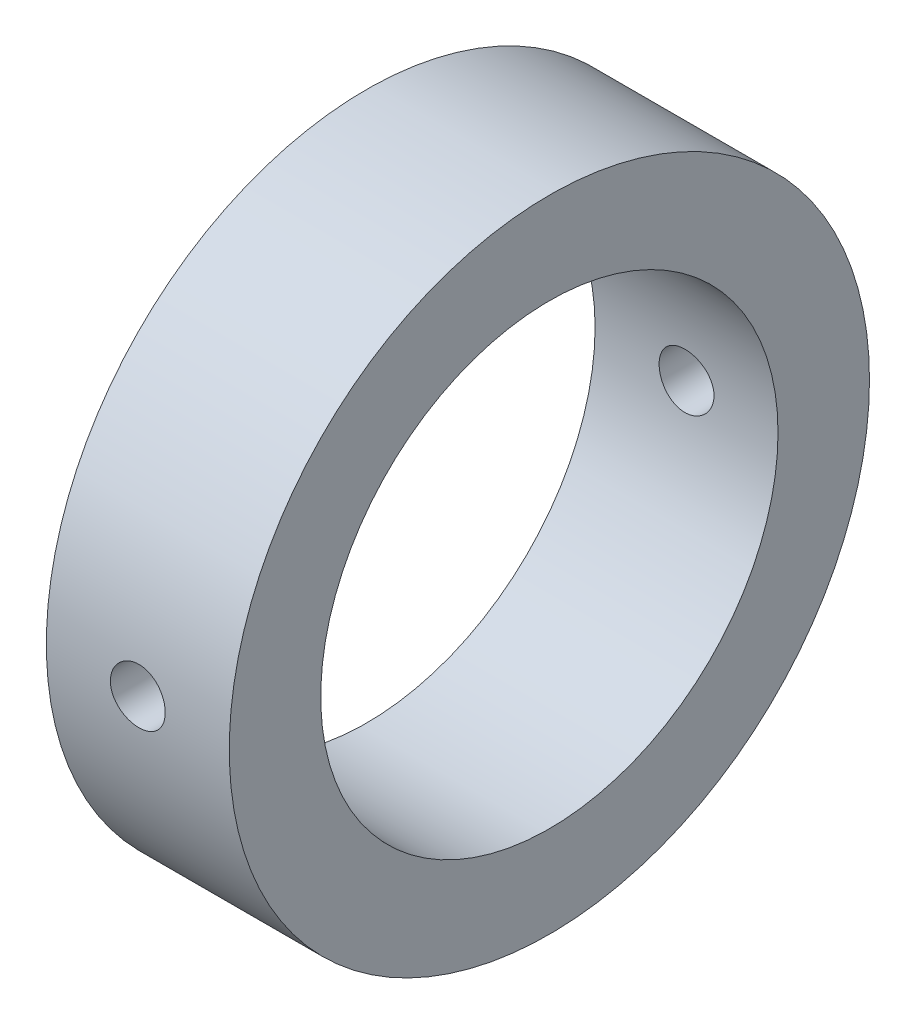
ISO-10303-21;
HEADER;
FILE_DESCRIPTION(('STEP AP214'),'2;1');
FILE_NAME('part.step','',(''),(''),'','','');
FILE_SCHEMA(('AUTOMOTIVE_DESIGN { 1 0 10303 214 1 1 1 1 }'));
ENDSEC;
DATA;
#1=APPLICATION_CONTEXT('core data for automotive mechanical design processes');
#2=APPLICATION_PROTOCOL_DEFINITION('international standard','automotive_design',2000,#1);
#3=PRODUCT_CONTEXT('',#1,'mechanical');
#4=PRODUCT('Part','Part','',(#3));
#5=PRODUCT_RELATED_PRODUCT_CATEGORY('part','',(#4));
#6=PRODUCT_DEFINITION_FORMATION('','',#4);
#7=PRODUCT_DEFINITION_CONTEXT('part definition',#1,'design');
#8=PRODUCT_DEFINITION('design','',#6,#7);
#9=PRODUCT_DEFINITION_SHAPE('','',#8);
#10=(LENGTH_UNIT() NAMED_UNIT(*) SI_UNIT(.MILLI.,.METRE.));
#11=(NAMED_UNIT(*) PLANE_ANGLE_UNIT() SI_UNIT($,.RADIAN.));
#12=(NAMED_UNIT(*) SI_UNIT($,.STERADIAN.) SOLID_ANGLE_UNIT());
#13=UNCERTAINTY_MEASURE_WITH_UNIT(LENGTH_MEASURE(1.E-05),#10,'distance_accuracy_value','');
#14=(GEOMETRIC_REPRESENTATION_CONTEXT(3) GLOBAL_UNCERTAINTY_ASSIGNED_CONTEXT((#13)) GLOBAL_UNIT_ASSIGNED_CONTEXT((#10,
#11,#12)) REPRESENTATION_CONTEXT('',''));
#15=CARTESIAN_POINT('',(0.,0.,0.));
#16=DIRECTION('',(0.,0.,1.));
#17=DIRECTION('',(1.,0.,0.));
#18=AXIS2_PLACEMENT_3D('',#15,#16,#17);
#19=CARTESIAN_POINT('',(20.,0.,0.));
#20=DIRECTION('',(1.,0.,0.));
#21=DIRECTION('',(0.,0.,-1.));
#22=AXIS2_PLACEMENT_3D('',#19,#20,#21);
#23=PLANE('',#22);
#24=CARTESIAN_POINT('',(20.,0.,0.));
#25=DIRECTION('',(1.,0.,0.));
#26=DIRECTION('',(0.,0.,-1.));
#27=AXIS2_PLACEMENT_3D('',#24,#25,#26);
#28=CIRCLE('',#27,35.);
#29=CARTESIAN_POINT('',(20.,0.,-35.));
#30=VERTEX_POINT('',#29);
#31=EDGE_CURVE('E10',#30,#30,#28,.T.);
#32=ORIENTED_EDGE('',*,*,#31,.T.);
#33=EDGE_LOOP('',(#32));
#34=FACE_BOUND('',#33,.T.);
#35=CARTESIAN_POINT('',(20.,0.,0.));
#36=DIRECTION('',(1.,0.,0.));
#37=DIRECTION('',(0.,0.,-1.));
#38=AXIS2_PLACEMENT_3D('',#35,#36,#37);
#39=CIRCLE('',#38,25.);
#40=CARTESIAN_POINT('',(20.,0.,-25.));
#41=VERTEX_POINT('',#40);
#42=EDGE_CURVE('E60',#41,#41,#39,.T.);
#43=ORIENTED_EDGE('',*,*,#42,.F.);
#44=EDGE_LOOP('',(#43));
#45=FACE_BOUND('',#44,.T.);
#46=ADVANCED_FACE('F41',(#34,#45),#23,.T.);
#47=CARTESIAN_POINT('',(0.,0.,0.));
#48=DIRECTION('',(1.,0.,0.));
#49=DIRECTION('',(0.,0.,-1.));
#50=AXIS2_PLACEMENT_3D('',#47,#48,#49);
#51=PLANE('',#50);
#52=CARTESIAN_POINT('',(0.,0.,0.));
#53=DIRECTION('',(1.,0.,0.));
#54=DIRECTION('',(0.,0.,-1.));
#55=AXIS2_PLACEMENT_3D('',#52,#53,#54);
#56=CIRCLE('',#55,35.);
#57=CARTESIAN_POINT('',(0.,0.,-35.));
#58=VERTEX_POINT('',#57);
#59=EDGE_CURVE('E55',#58,#58,#56,.T.);
#60=ORIENTED_EDGE('',*,*,#59,.F.);
#61=EDGE_LOOP('',(#60));
#62=FACE_BOUND('',#61,.T.);
#63=CARTESIAN_POINT('',(0.,0.,0.));
#64=DIRECTION('',(1.,0.,0.));
#65=DIRECTION('',(0.,0.,-1.));
#66=AXIS2_PLACEMENT_3D('',#63,#64,#65);
#67=CIRCLE('',#66,25.);
#68=CARTESIAN_POINT('',(0.,0.,-25.));
#69=VERTEX_POINT('',#68);
#70=EDGE_CURVE('E63',#69,#69,#67,.T.);
#71=ORIENTED_EDGE('',*,*,#70,.T.);
#72=EDGE_LOOP('',(#71));
#73=FACE_BOUND('',#72,.T.);
#74=ADVANCED_FACE('F99',(#62,#73),#51,.F.);
#75=CARTESIAN_POINT('',(20.,0.,0.));
#76=DIRECTION('',(-1.,0.,0.));
#77=DIRECTION('',(0.,0.,1.));
#78=AXIS2_PLACEMENT_3D('',#75,#76,#77);
#79=CYLINDRICAL_SURFACE('',#78,35.);
#80=CARTESIAN_POINT('',(13.,0.,-35.));
#81=CARTESIAN_POINT('',(12.9999926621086,0.168180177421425,-34.9999983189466));
#82=CARTESIAN_POINT('',(12.9858101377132,0.336474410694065,-34.9987748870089));
#83=CARTESIAN_POINT('',(12.9294427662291,0.668405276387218,-34.9940120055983));
#84=CARTESIAN_POINT('',(12.8872263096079,0.83203643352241,-34.9904699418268));
#85=CARTESIAN_POINT('',(12.7760219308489,1.14978580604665,-34.9814700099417));
#86=CARTESIAN_POINT('',(12.7070492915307,1.30390939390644,-34.9760132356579));
#87=CARTESIAN_POINT('',(12.5443180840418,1.5983553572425,-34.9637955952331));
#88=CARTESIAN_POINT('',(12.4505647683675,1.7386806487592,-34.9570350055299));
#89=CARTESIAN_POINT('',(12.2406617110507,2.00196024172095,-34.9429478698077));
#90=CARTESIAN_POINT('',(12.1244591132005,2.12487233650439,-34.9356200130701));
#91=CARTESIAN_POINT('',(11.8730679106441,2.34947428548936,-34.9212352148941));
#92=CARTESIAN_POINT('',(11.7378784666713,2.45116320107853,-34.9141782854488));
#93=CARTESIAN_POINT('',(11.4520942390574,2.63057608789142,-34.9011203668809));
#94=CARTESIAN_POINT('',(11.3014759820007,2.70826279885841,-34.895121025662));
#95=CARTESIAN_POINT('',(10.9892731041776,2.83722803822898,-34.8848727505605));
#96=CARTESIAN_POINT('',(10.8276886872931,2.88850705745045,-34.8806237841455));
#97=CARTESIAN_POINT('',(10.4985643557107,2.96307845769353,-34.8743684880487));
#98=CARTESIAN_POINT('',(10.3310401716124,2.98643979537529,-34.8723566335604));
#99=CARTESIAN_POINT('',(9.99443731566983,3.00472573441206,-34.8707859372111));
#100=CARTESIAN_POINT('',(9.82535867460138,2.99965089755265,-34.8712270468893));
#101=CARTESIAN_POINT('',(9.49091935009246,2.96126551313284,-34.874507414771));
#102=CARTESIAN_POINT('',(9.32554998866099,2.92802995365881,-34.8773403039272));
#103=CARTESIAN_POINT('',(9.00274549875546,2.83438308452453,-34.8850750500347));
#104=CARTESIAN_POINT('',(8.84531045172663,2.77397149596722,-34.8899769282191));
#105=CARTESIAN_POINT('',(8.54260489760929,2.62760362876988,-34.9013046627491));
#106=CARTESIAN_POINT('',(8.39735071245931,2.54161375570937,-34.9077325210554));
#107=CARTESIAN_POINT('',(8.12330862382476,2.34655446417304,-34.9213861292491));
#108=CARTESIAN_POINT('',(7.99452107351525,2.23748455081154,-34.9286118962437));
#109=CARTESIAN_POINT('',(7.75663207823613,1.99894091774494,-34.9430754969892));
#110=CARTESIAN_POINT('',(7.64759561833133,1.86940237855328,-34.9503132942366));
#111=CARTESIAN_POINT('',(7.45280656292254,1.59382461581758,-34.9639632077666));
#112=CARTESIAN_POINT('',(7.36705398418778,1.44778538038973,-34.9703753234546));
#113=CARTESIAN_POINT('',(7.2212707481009,1.1433091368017,-34.9816527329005));
#114=CARTESIAN_POINT('',(7.16124302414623,0.984870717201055,-34.9865178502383));
#115=CARTESIAN_POINT('',(7.06865924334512,0.660113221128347,-34.9941511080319));
#116=CARTESIAN_POINT('',(7.03610258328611,0.493794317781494,-34.9969192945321));
#117=CARTESIAN_POINT('',(6.99946669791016,0.158560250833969,-35.0000408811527));
#118=CARTESIAN_POINT('',(6.99529772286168,-0.0103450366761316,-35.0004018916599));
#119=CARTESIAN_POINT('',(7.01532035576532,-0.34645210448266,-34.9986887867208));
#120=CARTESIAN_POINT('',(7.03951168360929,-0.513653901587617,-34.9966146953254));
#121=CARTESIAN_POINT('',(7.11549382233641,-0.841351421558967,-34.9902695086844));
#122=CARTESIAN_POINT('',(7.16724297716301,-1.00185687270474,-34.9860017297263));
#123=CARTESIAN_POINT('',(7.29682922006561,-1.31190702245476,-34.9757485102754));
#124=CARTESIAN_POINT('',(7.37466674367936,-1.46145153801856,-34.9697630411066));
#125=CARTESIAN_POINT('',(7.55444535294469,-1.7457428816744,-34.9567262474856));
#126=CARTESIAN_POINT('',(7.65644583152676,-1.88045202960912,-34.9496723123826));
#127=CARTESIAN_POINT('',(7.88156921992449,-2.13086824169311,-34.9352996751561));
#128=CARTESIAN_POINT('',(8.00469251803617,-2.24657495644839,-34.9279809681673));
#129=CARTESIAN_POINT('',(8.26895626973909,-2.45601016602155,-34.9138810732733));
#130=CARTESIAN_POINT('',(8.41014326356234,-2.54968004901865,-34.9071013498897));
#131=CARTESIAN_POINT('',(8.70629524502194,-2.71198063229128,-34.8948680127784));
#132=CARTESIAN_POINT('',(8.8612600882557,-2.78061159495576,-34.8894143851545));
#133=CARTESIAN_POINT('',(9.18036221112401,-2.8907865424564,-34.8804590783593));
#134=CARTESIAN_POINT('',(9.34448707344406,-2.93236627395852,-34.8769548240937));
#135=CARTESIAN_POINT('',(9.67742005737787,-2.98737479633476,-34.872286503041));
#136=CARTESIAN_POINT('',(9.84622808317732,-3.0008041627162,-34.871122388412));
#137=CARTESIAN_POINT('',(10.1831530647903,-2.99912392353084,-34.8712668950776));
#138=CARTESIAN_POINT('',(10.3512704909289,-2.98410640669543,-34.8725675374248));
#139=CARTESIAN_POINT('',(10.6825859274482,-2.92615085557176,-34.8774780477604));
#140=CARTESIAN_POINT('',(10.8457839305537,-2.88321277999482,-34.8810879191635));
#141=CARTESIAN_POINT('',(11.1626330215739,-2.7706585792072,-34.8902080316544));
#142=CARTESIAN_POINT('',(11.3162847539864,-2.70104425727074,-34.8957181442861));
#143=CARTESIAN_POINT('',(11.6097355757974,-2.53712384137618,-34.9080181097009));
#144=CARTESIAN_POINT('',(11.7495348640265,-2.4428181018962,-34.9148079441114));
#145=CARTESIAN_POINT('',(12.0117838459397,-2.23184571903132,-34.9289284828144));
#146=CARTESIAN_POINT('',(12.1341785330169,-2.11511080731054,-34.9362607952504));
#147=CARTESIAN_POINT('',(12.357688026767,-1.86271960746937,-34.9506254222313));
#148=CARTESIAN_POINT('',(12.4587976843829,-1.72705875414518,-34.9576576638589));
#149=CARTESIAN_POINT('',(12.6370108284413,-1.44039065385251,-34.9706432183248));
#150=CARTESIAN_POINT('',(12.7140672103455,-1.28935405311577,-34.9765944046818));
#151=CARTESIAN_POINT('',(12.8416267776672,-0.976537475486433,-34.9867226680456));
#152=CARTESIAN_POINT('',(12.8921604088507,-0.814770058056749,-34.9909017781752));
#153=CARTESIAN_POINT('',(12.9524054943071,-0.543377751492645,-34.9959451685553));
#154=CARTESIAN_POINT('',(12.9702296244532,-0.4354969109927,-34.9974587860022));
#155=CARTESIAN_POINT('',(12.9940292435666,-0.218426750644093,-34.999486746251));
#156=CARTESIAN_POINT('',(13.0000047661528,-0.109237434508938,-35.0000010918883));
#157=CARTESIAN_POINT('',(13.,0.,-35.));
#158=B_SPLINE_CURVE_WITH_KNOTS('',3,(#80,#81,#82,#83,#84,#85,#86,#87,#88,#89,#90,#91,#92,#93,
#94,#95,#96,#97,#98,#99,#100,#101,#102,#103,#104,#105,#106,#107,#108,#109,#110,#111,#112,#113,
#114,#115,#116,#117,#118,#119,#120,#121,#122,#123,#124,#125,#126,#127,#128,#129,#130,#131,#132,
#133,#134,#135,#136,#137,#138,#139,#140,#141,#142,#143,#144,#145,#146,#147,#148,#149,#150,#151,
#152,#153,#154,#155,#156,#157),.UNSPECIFIED.,.T.,.F.,(4,2,2,2,2,2,2,2,2,2,2,2,2,2,2,2,2,2,2,2,2,
2,2,2,2,2,2,2,2,2,2,2,2,2,2,2,2,2,4),(0.,0.504141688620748,1.0088527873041,1.51327602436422,
2.01759242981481,2.5231110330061,3.0286519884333,3.53497383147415,4.04128626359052,
4.54634550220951,5.05139476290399,5.55510335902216,6.05881712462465,6.56319540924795,
7.06758450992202,7.57360414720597,8.07962414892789,8.58570183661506,9.09176841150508,
9.59623427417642,10.1006951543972,10.6043956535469,11.1081045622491,11.6130646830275,
12.1180340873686,12.6243317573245,13.1306241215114,13.636246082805,14.1418577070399,
14.6458353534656,15.1498137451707,15.6537580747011,16.1576951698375,16.6631911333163,
17.1688092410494,17.6754113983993,18.1814307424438,18.5088849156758,18.8363381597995),.UNSPECIFIED.);
#159=CARTESIAN_POINT('',(13.,0.,-35.));
#160=VERTEX_POINT('',#159);
#161=EDGE_CURVE('E88',#160,#160,#158,.T.);
#162=ORIENTED_EDGE('',*,*,#161,.T.);
#163=EDGE_LOOP('',(#162));
#164=FACE_BOUND('',#163,.T.);
#165=CARTESIAN_POINT('',(13.,0.,35.));
#166=CARTESIAN_POINT('',(12.9999926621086,-0.168180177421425,34.9999983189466));
#167=CARTESIAN_POINT('',(12.9858101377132,-0.336474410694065,34.9987748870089));
#168=CARTESIAN_POINT('',(12.9294427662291,-0.668405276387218,34.9940120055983));
#169=CARTESIAN_POINT('',(12.8872263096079,-0.83203643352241,34.9904699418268));
#170=CARTESIAN_POINT('',(12.7760219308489,-1.14978580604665,34.9814700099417));
#171=CARTESIAN_POINT('',(12.7070492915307,-1.30390939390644,34.9760132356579));
#172=CARTESIAN_POINT('',(12.5443180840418,-1.5983553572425,34.9637955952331));
#173=CARTESIAN_POINT('',(12.4505647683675,-1.7386806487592,34.9570350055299));
#174=CARTESIAN_POINT('',(12.2406617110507,-2.00196024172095,34.9429478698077));
#175=CARTESIAN_POINT('',(12.1244591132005,-2.12487233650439,34.9356200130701));
#176=CARTESIAN_POINT('',(11.8730679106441,-2.34947428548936,34.9212352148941));
#177=CARTESIAN_POINT('',(11.7378784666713,-2.45116320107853,34.9141782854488));
#178=CARTESIAN_POINT('',(11.4520942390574,-2.63057608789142,34.9011203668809));
#179=CARTESIAN_POINT('',(11.3014759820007,-2.70826279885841,34.895121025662));
#180=CARTESIAN_POINT('',(10.9892731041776,-2.83722803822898,34.8848727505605));
#181=CARTESIAN_POINT('',(10.8276886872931,-2.88850705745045,34.8806237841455));
#182=CARTESIAN_POINT('',(10.4985643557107,-2.96307845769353,34.8743684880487));
#183=CARTESIAN_POINT('',(10.3310401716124,-2.98643979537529,34.8723566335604));
#184=CARTESIAN_POINT('',(9.99443731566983,-3.00472573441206,34.8707859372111));
#185=CARTESIAN_POINT('',(9.82535867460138,-2.99965089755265,34.8712270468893));
#186=CARTESIAN_POINT('',(9.49091935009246,-2.96126551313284,34.874507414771));
#187=CARTESIAN_POINT('',(9.32554998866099,-2.92802995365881,34.8773403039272));
#188=CARTESIAN_POINT('',(9.00274549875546,-2.83438308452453,34.8850750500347));
#189=CARTESIAN_POINT('',(8.84531045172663,-2.77397149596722,34.8899769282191));
#190=CARTESIAN_POINT('',(8.54260489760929,-2.62760362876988,34.9013046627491));
#191=CARTESIAN_POINT('',(8.39735071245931,-2.54161375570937,34.9077325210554));
#192=CARTESIAN_POINT('',(8.12330862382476,-2.34655446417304,34.9213861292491));
#193=CARTESIAN_POINT('',(7.99452107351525,-2.23748455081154,34.9286118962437));
#194=CARTESIAN_POINT('',(7.75663207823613,-1.99894091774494,34.9430754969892));
#195=CARTESIAN_POINT('',(7.64759561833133,-1.86940237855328,34.9503132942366));
#196=CARTESIAN_POINT('',(7.45280656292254,-1.59382461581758,34.9639632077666));
#197=CARTESIAN_POINT('',(7.36705398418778,-1.44778538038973,34.9703753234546));
#198=CARTESIAN_POINT('',(7.2212707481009,-1.1433091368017,34.9816527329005));
#199=CARTESIAN_POINT('',(7.16124302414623,-0.984870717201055,34.9865178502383));
#200=CARTESIAN_POINT('',(7.06865924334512,-0.660113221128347,34.9941511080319));
#201=CARTESIAN_POINT('',(7.03610258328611,-0.493794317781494,34.9969192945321));
#202=CARTESIAN_POINT('',(6.99946669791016,-0.158560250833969,35.0000408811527));
#203=CARTESIAN_POINT('',(6.99529772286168,0.0103450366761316,35.0004018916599));
#204=CARTESIAN_POINT('',(7.01532035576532,0.34645210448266,34.9986887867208));
#205=CARTESIAN_POINT('',(7.03951168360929,0.513653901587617,34.9966146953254));
#206=CARTESIAN_POINT('',(7.11549382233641,0.841351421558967,34.9902695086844));
#207=CARTESIAN_POINT('',(7.16724297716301,1.00185687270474,34.9860017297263));
#208=CARTESIAN_POINT('',(7.29682922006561,1.31190702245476,34.9757485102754));
#209=CARTESIAN_POINT('',(7.37466674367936,1.46145153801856,34.9697630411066));
#210=CARTESIAN_POINT('',(7.55444535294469,1.7457428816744,34.9567262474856));
#211=CARTESIAN_POINT('',(7.65644583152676,1.88045202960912,34.9496723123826));
#212=CARTESIAN_POINT('',(7.88156921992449,2.13086824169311,34.9352996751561));
#213=CARTESIAN_POINT('',(8.00469251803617,2.24657495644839,34.9279809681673));
#214=CARTESIAN_POINT('',(8.26895626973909,2.45601016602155,34.9138810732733));
#215=CARTESIAN_POINT('',(8.41014326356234,2.54968004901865,34.9071013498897));
#216=CARTESIAN_POINT('',(8.70629524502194,2.71198063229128,34.8948680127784));
#217=CARTESIAN_POINT('',(8.8612600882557,2.78061159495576,34.8894143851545));
#218=CARTESIAN_POINT('',(9.18036221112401,2.8907865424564,34.8804590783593));
#219=CARTESIAN_POINT('',(9.34448707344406,2.93236627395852,34.8769548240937));
#220=CARTESIAN_POINT('',(9.67742005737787,2.98737479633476,34.872286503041));
#221=CARTESIAN_POINT('',(9.84622808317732,3.0008041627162,34.871122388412));
#222=CARTESIAN_POINT('',(10.1831530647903,2.99912392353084,34.8712668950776));
#223=CARTESIAN_POINT('',(10.3512704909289,2.98410640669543,34.8725675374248));
#224=CARTESIAN_POINT('',(10.6825859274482,2.92615085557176,34.8774780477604));
#225=CARTESIAN_POINT('',(10.8457839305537,2.88321277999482,34.8810879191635));
#226=CARTESIAN_POINT('',(11.1626330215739,2.7706585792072,34.8902080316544));
#227=CARTESIAN_POINT('',(11.3162847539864,2.70104425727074,34.8957181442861));
#228=CARTESIAN_POINT('',(11.6097355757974,2.53712384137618,34.9080181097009));
#229=CARTESIAN_POINT('',(11.7495348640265,2.4428181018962,34.9148079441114));
#230=CARTESIAN_POINT('',(12.0117838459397,2.23184571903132,34.9289284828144));
#231=CARTESIAN_POINT('',(12.1341785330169,2.11511080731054,34.9362607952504));
#232=CARTESIAN_POINT('',(12.357688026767,1.86271960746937,34.9506254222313));
#233=CARTESIAN_POINT('',(12.4587976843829,1.72705875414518,34.9576576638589));
#234=CARTESIAN_POINT('',(12.6370108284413,1.44039065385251,34.9706432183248));
#235=CARTESIAN_POINT('',(12.7140672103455,1.28935405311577,34.9765944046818));
#236=CARTESIAN_POINT('',(12.8416267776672,0.976537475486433,34.9867226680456));
#237=CARTESIAN_POINT('',(12.8921604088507,0.814770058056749,34.9909017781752));
#238=CARTESIAN_POINT('',(12.9524054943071,0.543377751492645,34.9959451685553));
#239=CARTESIAN_POINT('',(12.9702296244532,0.4354969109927,34.9974587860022));
#240=CARTESIAN_POINT('',(12.9940292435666,0.218426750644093,34.999486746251));
#241=CARTESIAN_POINT('',(13.0000047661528,0.109237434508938,35.0000010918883));
#242=CARTESIAN_POINT('',(13.,0.,35.));
#243=B_SPLINE_CURVE_WITH_KNOTS('',3,(#165,#166,#167,#168,#169,#170,#171,#172,#173,#174,#175,
#176,#177,#178,#179,#180,#181,#182,#183,#184,#185,#186,#187,#188,#189,#190,#191,#192,#193,#194,
#195,#196,#197,#198,#199,#200,#201,#202,#203,#204,#205,#206,#207,#208,#209,#210,#211,#212,#213,
#214,#215,#216,#217,#218,#219,#220,#221,#222,#223,#224,#225,#226,#227,#228,#229,#230,#231,#232,
#233,#234,#235,#236,#237,#238,#239,#240,#241,#242),.UNSPECIFIED.,.T.,.F.,(4,2,2,2,2,2,2,2,2,2,2,
2,2,2,2,2,2,2,2,2,2,2,2,2,2,2,2,2,2,2,2,2,2,2,2,2,2,2,4),(0.,0.504141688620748,1.0088527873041,
1.51327602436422,2.01759242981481,2.5231110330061,3.0286519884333,3.53497383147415,
4.04128626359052,4.54634550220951,5.05139476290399,5.55510335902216,6.05881712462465,
6.56319540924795,7.06758450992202,7.57360414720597,8.07962414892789,8.58570183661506,
9.09176841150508,9.59623427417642,10.1006951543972,10.6043956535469,11.1081045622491,
11.6130646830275,12.1180340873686,12.6243317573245,13.1306241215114,13.636246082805,
14.1418577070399,14.6458353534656,15.1498137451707,15.6537580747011,16.1576951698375,
16.6631911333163,17.1688092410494,17.6754113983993,18.1814307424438,18.5088849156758,
18.8363381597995),.UNSPECIFIED.);
#244=CARTESIAN_POINT('',(13.,0.,35.));
#245=VERTEX_POINT('',#244);
#246=EDGE_CURVE('E83',#245,#245,#243,.T.);
#247=ORIENTED_EDGE('',*,*,#246,.T.);
#248=EDGE_LOOP('',(#247));
#249=FACE_BOUND('',#248,.T.);
#250=ORIENTED_EDGE('',*,*,#31,.F.);
#251=EDGE_LOOP('',(#250));
#252=FACE_BOUND('',#251,.T.);
#253=ORIENTED_EDGE('',*,*,#59,.T.);
#254=EDGE_LOOP('',(#253));
#255=FACE_BOUND('',#254,.T.);
#256=ADVANCED_FACE('F43',(#164,#249,#252,#255),#79,.T.);
#257=CARTESIAN_POINT('',(20.,0.,0.));
#258=DIRECTION('',(-1.,0.,0.));
#259=DIRECTION('',(0.,0.,1.));
#260=AXIS2_PLACEMENT_3D('',#257,#258,#259);
#261=CYLINDRICAL_SURFACE('',#260,25.);
#262=CARTESIAN_POINT('',(13.,0.,25.));
#263=CARTESIAN_POINT('',(12.9999928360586,-0.167864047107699,24.9999977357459));
#264=CARTESIAN_POINT('',(12.9858633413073,-0.335834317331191,24.9982914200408));
#265=CARTESIAN_POINT('',(12.9297189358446,-0.66710457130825,24.991648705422));
#266=CARTESIAN_POINT('',(12.8876745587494,-0.830399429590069,24.9867088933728));
#267=CARTESIAN_POINT('',(12.776953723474,-1.14747479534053,24.9741559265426));
#268=CARTESIAN_POINT('',(12.7082947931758,-1.30126148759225,24.9665445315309));
#269=CARTESIAN_POINT('',(12.5463312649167,-1.595099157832,24.9494959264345));
#270=CARTESIAN_POINT('',(12.4530310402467,-1.73515256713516,24.9400590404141));
#271=CARTESIAN_POINT('',(12.2439251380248,-1.99829131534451,24.920360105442));
#272=CARTESIAN_POINT('',(12.1280191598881,-2.1212966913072,24.9100945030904));
#273=CARTESIAN_POINT('',(11.8772070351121,-2.34615931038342,24.8899239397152));
#274=CARTESIAN_POINT('',(11.7422999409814,-2.44801549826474,24.8800189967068));
#275=CARTESIAN_POINT('',(11.4567991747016,-2.62798342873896,24.8616560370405));
#276=CARTESIAN_POINT('',(11.3061582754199,-2.7060207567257,24.8532025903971));
#277=CARTESIAN_POINT('',(10.9937912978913,-2.8356605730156,24.8387461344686));
#278=CARTESIAN_POINT('',(10.8320656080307,-2.88726398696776,24.8327430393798));
#279=CARTESIAN_POINT('',(10.5029471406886,-2.96232930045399,24.8239006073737));
#280=CARTESIAN_POINT('',(10.3355854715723,-2.98592577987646,24.8210461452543));
#281=CARTESIAN_POINT('',(9.99925506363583,-3.0047237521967,24.8187777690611));
#282=CARTESIAN_POINT('',(9.83028638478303,-2.99992630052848,24.8193637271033));
#283=CARTESIAN_POINT('',(9.49647403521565,-2.96218316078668,24.8238961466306));
#284=CARTESIAN_POINT('',(9.33161336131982,-2.92938543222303,24.8278249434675));
#285=CARTESIAN_POINT('',(9.00975297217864,-2.83680346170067,24.8385728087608));
#286=CARTESIAN_POINT('',(8.85275340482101,-2.77701871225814,24.8453919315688));
#287=CARTESIAN_POINT('',(8.55061053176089,-2.63199980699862,24.8611722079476));
#288=CARTESIAN_POINT('',(8.40549852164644,-2.54670106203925,24.8701387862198));
#289=CARTESIAN_POINT('',(8.13159278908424,-2.35312173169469,24.8891993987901));
#290=CARTESIAN_POINT('',(8.00279975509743,-2.24484017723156,24.8992934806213));
#291=CARTESIAN_POINT('',(7.76432891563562,-2.0075475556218,24.9195503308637));
#292=CARTESIAN_POINT('',(7.65477803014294,-1.87840890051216,24.929713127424));
#293=CARTESIAN_POINT('',(7.45888847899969,-1.60350795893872,24.9489020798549));
#294=CARTESIAN_POINT('',(7.37254985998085,-1.45774563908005,24.9579282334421));
#295=CARTESIAN_POINT('',(7.22553671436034,-1.15363930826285,24.9738318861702));
#296=CARTESIAN_POINT('',(7.16486980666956,-0.995291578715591,24.9807087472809));
#297=CARTESIAN_POINT('',(7.0710212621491,-0.670556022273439,24.991533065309));
#298=CARTESIAN_POINT('',(7.03783843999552,-0.504168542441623,24.9954806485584));
#299=CARTESIAN_POINT('',(7.00006374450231,-0.169174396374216,24.9999852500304));
#300=CARTESIAN_POINT('',(6.9952969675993,-0.000587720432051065,25.0005630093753));
#301=CARTESIAN_POINT('',(7.01402857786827,0.334982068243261,24.9983187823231));
#302=CARTESIAN_POINT('',(7.03752641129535,0.501965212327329,24.9954968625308));
#303=CARTESIAN_POINT('',(7.11197496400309,0.829074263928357,24.9867833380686));
#304=CARTESIAN_POINT('',(7.16284261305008,0.989219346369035,24.9809010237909));
#305=CARTESIAN_POINT('',(7.29050070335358,1.29870539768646,24.9667255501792));
#306=CARTESIAN_POINT('',(7.36729196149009,1.44804602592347,24.9584323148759));
#307=CARTESIAN_POINT('',(7.54504291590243,1.73246717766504,24.9403085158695));
#308=CARTESIAN_POINT('',(7.64611613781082,1.86747628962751,24.9304708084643));
#309=CARTESIAN_POINT('',(7.86940084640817,2.11867625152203,24.9103817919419));
#310=CARTESIAN_POINT('',(7.99161310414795,2.23486641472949,24.9001304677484));
#311=CARTESIAN_POINT('',(8.25447561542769,2.44574795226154,24.8803059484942));
#312=CARTESIAN_POINT('',(8.39521901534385,2.54032363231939,24.8707365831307));
#313=CARTESIAN_POINT('',(8.69069502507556,2.70449314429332,24.8534214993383));
#314=CARTESIAN_POINT('',(8.84542737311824,2.77408744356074,24.8456757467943));
#315=CARTESIAN_POINT('',(9.1641106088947,2.88612996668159,24.8329105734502));
#316=CARTESIAN_POINT('',(9.32803801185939,2.92864420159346,24.8278845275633));
#317=CARTESIAN_POINT('',(9.66076896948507,2.98553272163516,24.8211085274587));
#318=CARTESIAN_POINT('',(9.82957231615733,2.99990820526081,24.8193584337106));
#319=CARTESIAN_POINT('',(10.1661127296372,3.00009033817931,24.819336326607));
#320=CARTESIAN_POINT('',(10.3338497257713,2.98607873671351,24.8210421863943));
#321=CARTESIAN_POINT('',(10.6645667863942,2.93026848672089,24.8276922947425));
#322=CARTESIAN_POINT('',(10.8275468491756,2.88846982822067,24.8326365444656));
#323=CARTESIAN_POINT('',(11.1441045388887,2.77832739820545,24.8451996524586));
#324=CARTESIAN_POINT('',(11.2976849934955,2.70999165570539,24.8528177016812));
#325=CARTESIAN_POINT('',(11.5912277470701,2.5487328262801,24.8698714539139));
#326=CARTESIAN_POINT('',(11.7311899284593,2.45580952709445,24.8793071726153));
#327=CARTESIAN_POINT('',(11.9944529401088,2.24733689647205,24.8990055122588));
#328=CARTESIAN_POINT('',(12.1176461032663,2.1316520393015,24.9092728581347));
#329=CARTESIAN_POINT('',(12.342942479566,1.88122093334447,24.9294354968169));
#330=CARTESIAN_POINT('',(12.4450406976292,1.74647018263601,24.939330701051));
#331=CARTESIAN_POINT('',(12.6255505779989,1.46119322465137,24.9576721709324));
#332=CARTESIAN_POINT('',(12.7038777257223,1.31061323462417,24.966113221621));
#333=CARTESIAN_POINT('',(12.8340237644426,0.99842275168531,24.9805418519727));
#334=CARTESIAN_POINT('',(12.8858716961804,0.836824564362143,24.9865321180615));
#335=CARTESIAN_POINT('',(12.9490634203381,0.561977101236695,24.9939268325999));
#336=CARTESIAN_POINT('',(12.9681374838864,0.450466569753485,24.996193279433));
#337=CARTESIAN_POINT('',(12.993608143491,0.225986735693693,24.9992306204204));
#338=CARTESIAN_POINT('',(13.0000048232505,0.113017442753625,25.0000015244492));
#339=CARTESIAN_POINT('',(13.,0.,25.));
#340=B_SPLINE_CURVE_WITH_KNOTS('',3,(#262,#263,#264,#265,#266,#267,#268,#269,#270,#271,#272,
#273,#274,#275,#276,#277,#278,#279,#280,#281,#282,#283,#284,#285,#286,#287,#288,#289,#290,#291,
#292,#293,#294,#295,#296,#297,#298,#299,#300,#301,#302,#303,#304,#305,#306,#307,#308,#309,#310,
#311,#312,#313,#314,#315,#316,#317,#318,#319,#320,#321,#322,#323,#324,#325,#326,#327,#328,#329,
#330,#331,#332,#333,#334,#335,#336,#337,#338,#339),.UNSPECIFIED.,.T.,.F.,(4,2,2,2,2,2,2,2,2,2,2,
2,2,2,2,2,2,2,2,2,2,2,2,2,2,2,2,2,2,2,2,2,2,2,2,2,2,2,4),(0.,0.503179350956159,1.00689069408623,
1.5102708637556,2.01356175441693,2.51913872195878,3.02474090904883,3.53190689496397,
4.03905511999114,4.54375638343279,5.0484388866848,5.55047092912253,6.05251241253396,
6.55583573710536,7.05918028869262,7.56572944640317,8.07227962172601,8.57898002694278,
9.08565857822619,9.58921522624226,10.0927620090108,10.5947890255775,11.0968318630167,
11.6012692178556,12.1057249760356,12.6128207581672,13.119907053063,13.6257524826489,
14.1315763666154,14.6341719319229,15.1367676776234,15.6392114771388,16.1416596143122,
16.6471952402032,17.1528504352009,17.6602829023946,18.1671576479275,18.5059342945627,
18.8447087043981),.UNSPECIFIED.);
#341=CARTESIAN_POINT('',(13.,0.,25.));
#342=VERTEX_POINT('',#341);
#343=EDGE_CURVE('E46',#342,#342,#340,.T.);
#344=ORIENTED_EDGE('',*,*,#343,.F.);
#345=EDGE_LOOP('',(#344));
#346=FACE_BOUND('',#345,.T.);
#347=CARTESIAN_POINT('',(13.,0.,-25.));
#348=CARTESIAN_POINT('',(12.9999928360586,0.167864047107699,-24.9999977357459));
#349=CARTESIAN_POINT('',(12.9858633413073,0.335834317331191,-24.9982914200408));
#350=CARTESIAN_POINT('',(12.9297189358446,0.66710457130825,-24.991648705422));
#351=CARTESIAN_POINT('',(12.8876745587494,0.830399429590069,-24.9867088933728));
#352=CARTESIAN_POINT('',(12.776953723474,1.14747479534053,-24.9741559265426));
#353=CARTESIAN_POINT('',(12.7082947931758,1.30126148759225,-24.9665445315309));
#354=CARTESIAN_POINT('',(12.5463312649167,1.595099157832,-24.9494959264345));
#355=CARTESIAN_POINT('',(12.4530310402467,1.73515256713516,-24.9400590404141));
#356=CARTESIAN_POINT('',(12.2439251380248,1.99829131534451,-24.920360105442));
#357=CARTESIAN_POINT('',(12.1280191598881,2.1212966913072,-24.9100945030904));
#358=CARTESIAN_POINT('',(11.8772070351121,2.34615931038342,-24.8899239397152));
#359=CARTESIAN_POINT('',(11.7422999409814,2.44801549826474,-24.8800189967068));
#360=CARTESIAN_POINT('',(11.4567991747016,2.62798342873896,-24.8616560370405));
#361=CARTESIAN_POINT('',(11.3061582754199,2.7060207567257,-24.8532025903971));
#362=CARTESIAN_POINT('',(10.9937912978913,2.8356605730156,-24.8387461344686));
#363=CARTESIAN_POINT('',(10.8320656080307,2.88726398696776,-24.8327430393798));
#364=CARTESIAN_POINT('',(10.5029471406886,2.96232930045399,-24.8239006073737));
#365=CARTESIAN_POINT('',(10.3355854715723,2.98592577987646,-24.8210461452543));
#366=CARTESIAN_POINT('',(9.99925506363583,3.0047237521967,-24.8187777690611));
#367=CARTESIAN_POINT('',(9.83028638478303,2.99992630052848,-24.8193637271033));
#368=CARTESIAN_POINT('',(9.49647403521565,2.96218316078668,-24.8238961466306));
#369=CARTESIAN_POINT('',(9.33161336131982,2.92938543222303,-24.8278249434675));
#370=CARTESIAN_POINT('',(9.00975297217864,2.83680346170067,-24.8385728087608));
#371=CARTESIAN_POINT('',(8.85275340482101,2.77701871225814,-24.8453919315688));
#372=CARTESIAN_POINT('',(8.55061053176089,2.63199980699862,-24.8611722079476));
#373=CARTESIAN_POINT('',(8.40549852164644,2.54670106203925,-24.8701387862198));
#374=CARTESIAN_POINT('',(8.13159278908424,2.35312173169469,-24.8891993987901));
#375=CARTESIAN_POINT('',(8.00279975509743,2.24484017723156,-24.8992934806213));
#376=CARTESIAN_POINT('',(7.76432891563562,2.0075475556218,-24.9195503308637));
#377=CARTESIAN_POINT('',(7.65477803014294,1.87840890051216,-24.929713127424));
#378=CARTESIAN_POINT('',(7.45888847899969,1.60350795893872,-24.9489020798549));
#379=CARTESIAN_POINT('',(7.37254985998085,1.45774563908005,-24.9579282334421));
#380=CARTESIAN_POINT('',(7.22553671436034,1.15363930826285,-24.9738318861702));
#381=CARTESIAN_POINT('',(7.16486980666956,0.995291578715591,-24.9807087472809));
#382=CARTESIAN_POINT('',(7.0710212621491,0.670556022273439,-24.991533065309));
#383=CARTESIAN_POINT('',(7.03783843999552,0.504168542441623,-24.9954806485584));
#384=CARTESIAN_POINT('',(7.00006374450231,0.169174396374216,-24.9999852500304));
#385=CARTESIAN_POINT('',(6.9952969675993,0.000587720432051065,-25.0005630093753));
#386=CARTESIAN_POINT('',(7.01402857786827,-0.334982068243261,-24.9983187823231));
#387=CARTESIAN_POINT('',(7.03752641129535,-0.501965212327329,-24.9954968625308));
#388=CARTESIAN_POINT('',(7.11197496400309,-0.829074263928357,-24.9867833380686));
#389=CARTESIAN_POINT('',(7.16284261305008,-0.989219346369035,-24.9809010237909));
#390=CARTESIAN_POINT('',(7.29050070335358,-1.29870539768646,-24.9667255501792));
#391=CARTESIAN_POINT('',(7.36729196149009,-1.44804602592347,-24.9584323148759));
#392=CARTESIAN_POINT('',(7.54504291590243,-1.73246717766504,-24.9403085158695));
#393=CARTESIAN_POINT('',(7.64611613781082,-1.86747628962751,-24.9304708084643));
#394=CARTESIAN_POINT('',(7.86940084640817,-2.11867625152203,-24.9103817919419));
#395=CARTESIAN_POINT('',(7.99161310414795,-2.23486641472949,-24.9001304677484));
#396=CARTESIAN_POINT('',(8.25447561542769,-2.44574795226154,-24.8803059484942));
#397=CARTESIAN_POINT('',(8.39521901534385,-2.54032363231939,-24.8707365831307));
#398=CARTESIAN_POINT('',(8.69069502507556,-2.70449314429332,-24.8534214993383));
#399=CARTESIAN_POINT('',(8.84542737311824,-2.77408744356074,-24.8456757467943));
#400=CARTESIAN_POINT('',(9.1641106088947,-2.88612996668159,-24.8329105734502));
#401=CARTESIAN_POINT('',(9.32803801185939,-2.92864420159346,-24.8278845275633));
#402=CARTESIAN_POINT('',(9.66076896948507,-2.98553272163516,-24.8211085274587));
#403=CARTESIAN_POINT('',(9.82957231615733,-2.99990820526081,-24.8193584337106));
#404=CARTESIAN_POINT('',(10.1661127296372,-3.00009033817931,-24.819336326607));
#405=CARTESIAN_POINT('',(10.3338497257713,-2.98607873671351,-24.8210421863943));
#406=CARTESIAN_POINT('',(10.6645667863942,-2.93026848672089,-24.8276922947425));
#407=CARTESIAN_POINT('',(10.8275468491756,-2.88846982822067,-24.8326365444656));
#408=CARTESIAN_POINT('',(11.1441045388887,-2.77832739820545,-24.8451996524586));
#409=CARTESIAN_POINT('',(11.2976849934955,-2.70999165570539,-24.8528177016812));
#410=CARTESIAN_POINT('',(11.5912277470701,-2.5487328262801,-24.8698714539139));
#411=CARTESIAN_POINT('',(11.7311899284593,-2.45580952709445,-24.8793071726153));
#412=CARTESIAN_POINT('',(11.9944529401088,-2.24733689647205,-24.8990055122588));
#413=CARTESIAN_POINT('',(12.1176461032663,-2.1316520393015,-24.9092728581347));
#414=CARTESIAN_POINT('',(12.342942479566,-1.88122093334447,-24.9294354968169));
#415=CARTESIAN_POINT('',(12.4450406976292,-1.74647018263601,-24.939330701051));
#416=CARTESIAN_POINT('',(12.6255505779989,-1.46119322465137,-24.9576721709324));
#417=CARTESIAN_POINT('',(12.7038777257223,-1.31061323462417,-24.966113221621));
#418=CARTESIAN_POINT('',(12.8340237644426,-0.99842275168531,-24.9805418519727));
#419=CARTESIAN_POINT('',(12.8858716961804,-0.836824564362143,-24.9865321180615));
#420=CARTESIAN_POINT('',(12.9490634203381,-0.561977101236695,-24.9939268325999));
#421=CARTESIAN_POINT('',(12.9681374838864,-0.450466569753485,-24.996193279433));
#422=CARTESIAN_POINT('',(12.993608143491,-0.225986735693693,-24.9992306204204));
#423=CARTESIAN_POINT('',(13.0000048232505,-0.113017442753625,-25.0000015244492));
#424=CARTESIAN_POINT('',(13.,0.,-25.));
#425=B_SPLINE_CURVE_WITH_KNOTS('',3,(#347,#348,#349,#350,#351,#352,#353,#354,#355,#356,#357,
#358,#359,#360,#361,#362,#363,#364,#365,#366,#367,#368,#369,#370,#371,#372,#373,#374,#375,#376,
#377,#378,#379,#380,#381,#382,#383,#384,#385,#386,#387,#388,#389,#390,#391,#392,#393,#394,#395,
#396,#397,#398,#399,#400,#401,#402,#403,#404,#405,#406,#407,#408,#409,#410,#411,#412,#413,#414,
#415,#416,#417,#418,#419,#420,#421,#422,#423,#424),.UNSPECIFIED.,.T.,.F.,(4,2,2,2,2,2,2,2,2,2,2,
2,2,2,2,2,2,2,2,2,2,2,2,2,2,2,2,2,2,2,2,2,2,2,2,2,2,2,4),(0.,0.503179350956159,1.00689069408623,
1.5102708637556,2.01356175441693,2.51913872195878,3.02474090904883,3.53190689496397,
4.03905511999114,4.54375638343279,5.0484388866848,5.55047092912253,6.05251241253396,
6.55583573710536,7.05918028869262,7.56572944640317,8.07227962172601,8.57898002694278,
9.08565857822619,9.58921522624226,10.0927620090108,10.5947890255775,11.0968318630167,
11.6012692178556,12.1057249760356,12.6128207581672,13.119907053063,13.6257524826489,
14.1315763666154,14.6341719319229,15.1367676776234,15.6392114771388,16.1416596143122,
16.6471952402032,17.1528504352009,17.6602829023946,18.1671576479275,18.5059342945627,
18.8447087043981),.UNSPECIFIED.);
#426=CARTESIAN_POINT('',(13.,0.,-25.));
#427=VERTEX_POINT('',#426);
#428=EDGE_CURVE('E65',#427,#427,#425,.T.);
#429=ORIENTED_EDGE('',*,*,#428,.F.);
#430=EDGE_LOOP('',(#429));
#431=FACE_BOUND('',#430,.T.);
#432=ORIENTED_EDGE('',*,*,#42,.T.);
#433=EDGE_LOOP('',(#432));
#434=FACE_BOUND('',#433,.T.);
#435=ORIENTED_EDGE('',*,*,#70,.F.);
#436=EDGE_LOOP('',(#435));
#437=FACE_BOUND('',#436,.T.);
#438=ADVANCED_FACE('F70',(#346,#431,#434,#437),#261,.F.);
#439=CARTESIAN_POINT('',(10.,0.,-35.));
#440=DIRECTION('',(0.,0.,1.));
#441=DIRECTION('',(1.,0.,0.));
#442=AXIS2_PLACEMENT_3D('',#439,#440,#441);
#443=CYLINDRICAL_SURFACE('',#442,3.);
#444=ORIENTED_EDGE('',*,*,#428,.T.);
#445=EDGE_LOOP('',(#444));
#446=FACE_BOUND('',#445,.T.);
#447=ORIENTED_EDGE('',*,*,#161,.F.);
#448=EDGE_LOOP('',(#447));
#449=FACE_BOUND('',#448,.T.);
#450=ADVANCED_FACE('F73',(#446,#449),#443,.F.);
#451=ORIENTED_EDGE('',*,*,#343,.T.);
#452=EDGE_LOOP('',(#451));
#453=FACE_BOUND('',#452,.T.);
#454=ORIENTED_EDGE('',*,*,#246,.F.);
#455=EDGE_LOOP('',(#454));
#456=FACE_BOUND('',#455,.T.);
#457=ADVANCED_FACE('F76',(#453,#456),#443,.F.);
#458=CLOSED_SHELL('',(#46,#74,#256,#438,#450,#457));
#459=MANIFOLD_SOLID_BREP('B2',#458);
#460=ADVANCED_BREP_SHAPE_REPRESENTATION('',(#18,#459),#14);
#461=SHAPE_DEFINITION_REPRESENTATION(#9,#460);
ENDSEC;
END-ISO-10303-21;
